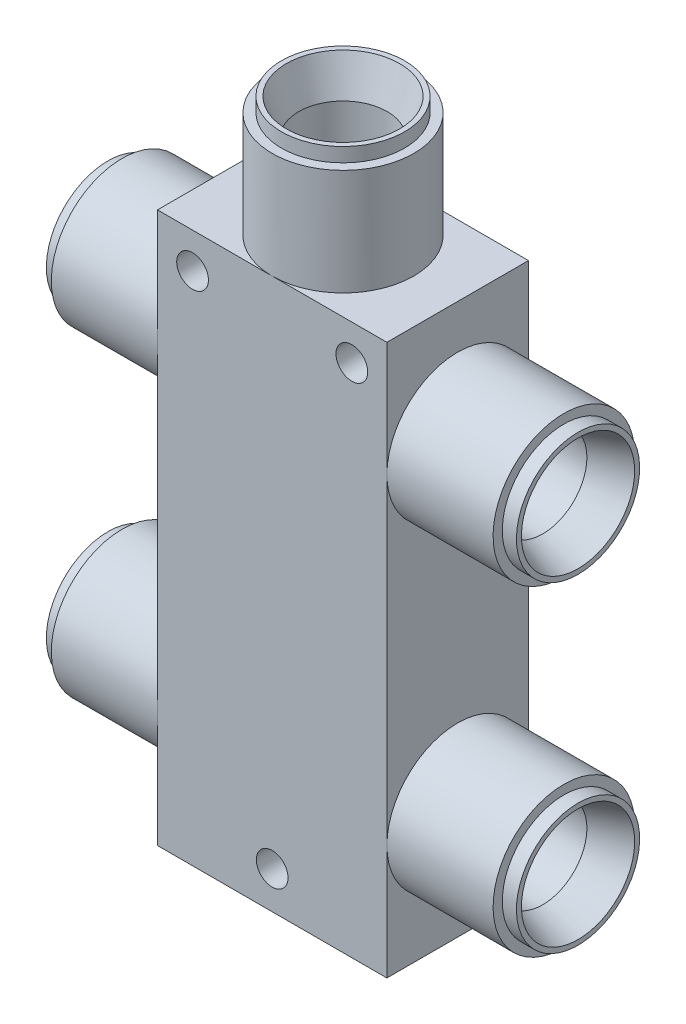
ISO-10303-21;
HEADER;
FILE_DESCRIPTION(('STEP AP214'),'2;1');
FILE_NAME('part.step','',(''),(''),'','','');
FILE_SCHEMA(('AUTOMOTIVE_DESIGN { 1 0 10303 214 1 1 1 1 }'));
ENDSEC;
DATA;
#1=APPLICATION_CONTEXT('core data for automotive mechanical design processes');
#2=APPLICATION_PROTOCOL_DEFINITION('international standard','automotive_design',2000,#1);
#3=PRODUCT_CONTEXT('',#1,'mechanical');
#4=PRODUCT('Part','Part','',(#3));
#5=PRODUCT_RELATED_PRODUCT_CATEGORY('part','',(#4));
#6=PRODUCT_DEFINITION_FORMATION('','',#4);
#7=PRODUCT_DEFINITION_CONTEXT('part definition',#1,'design');
#8=PRODUCT_DEFINITION('design','',#6,#7);
#9=PRODUCT_DEFINITION_SHAPE('','',#8);
#10=(LENGTH_UNIT() NAMED_UNIT(*) SI_UNIT(.MILLI.,.METRE.));
#11=(NAMED_UNIT(*) PLANE_ANGLE_UNIT() SI_UNIT($,.RADIAN.));
#12=(NAMED_UNIT(*) SI_UNIT($,.STERADIAN.) SOLID_ANGLE_UNIT());
#13=UNCERTAINTY_MEASURE_WITH_UNIT(LENGTH_MEASURE(1.E-05),#10,'distance_accuracy_value','');
#14=(GEOMETRIC_REPRESENTATION_CONTEXT(3) GLOBAL_UNCERTAINTY_ASSIGNED_CONTEXT((#13)) GLOBAL_UNIT_ASSIGNED_CONTEXT((#10,
#11,#12)) REPRESENTATION_CONTEXT('',''));
#15=CARTESIAN_POINT('',(0.,0.,0.));
#16=DIRECTION('',(0.,0.,1.));
#17=DIRECTION('',(1.,0.,0.));
#18=AXIS2_PLACEMENT_3D('',#15,#16,#17);
#19=CARTESIAN_POINT('',(10.287,0.,0.));
#20=DIRECTION('',(0.,-1.,0.));
#21=DIRECTION('',(0.,0.,-1.));
#22=AXIS2_PLACEMENT_3D('',#19,#20,#21);
#23=CYLINDRICAL_SURFACE('',#22,3.96875);
#24=CARTESIAN_POINT('',(10.287,56.9988667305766,0.));
#25=DIRECTION('',(0.,-1.,0.));
#26=DIRECTION('',(0.,0.,-1.));
#27=AXIS2_PLACEMENT_3D('',#24,#25,#26);
#28=CIRCLE('',#27,3.96875);
#29=CARTESIAN_POINT('',(10.287,56.9988667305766,-3.96875000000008));
#30=VERTEX_POINT('',#29);
#31=EDGE_CURVE('E190',#30,#30,#28,.T.);
#32=ORIENTED_EDGE('',*,*,#31,.F.);
#33=EDGE_LOOP('',(#32));
#34=FACE_BOUND('',#33,.T.);
#35=CARTESIAN_POINT('',(10.2870000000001,39.0918667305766,0.));
#36=DIRECTION('',(0.707106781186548,-0.707106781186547,0.));
#37=DIRECTION('',(-0.707106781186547,-0.707106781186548,0.));
#38=AXIS2_PLACEMENT_3D('',#35,#36,#37);
#39=ELLIPSE('',#38,5.61266007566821,3.96874999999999);
#40=CARTESIAN_POINT('',(10.2870000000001,39.0918667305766,3.96874999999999));
#41=VERTEX_POINT('',#40);
#42=CARTESIAN_POINT('',(10.287,39.0918667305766,-3.96875000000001));
#43=VERTEX_POINT('',#42);
#44=EDGE_CURVE('E116',#41,#43,#39,.F.);
#45=ORIENTED_EDGE('',*,*,#44,.F.);
#46=CARTESIAN_POINT('',(10.2870000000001,39.0918667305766,0.));
#47=DIRECTION('',(-0.707106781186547,-0.707106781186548,0.));
#48=DIRECTION('',(0.707106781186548,-0.707106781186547,0.));
#49=AXIS2_PLACEMENT_3D('',#46,#47,#48);
#50=ELLIPSE('',#49,5.61266007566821,3.96874999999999);
#51=EDGE_CURVE('E53',#43,#41,#50,.F.);
#52=ORIENTED_EDGE('',*,*,#51,.F.);
#53=EDGE_LOOP('',(#45,#52));
#54=FACE_BOUND('',#53,.T.);
#55=ADVANCED_FACE('F34',(#34,#54),#23,.F.);
#56=CARTESIAN_POINT('',(20.5740000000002,-19.3543781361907,-6.35));
#57=DIRECTION('',(1.,0.,0.));
#58=DIRECTION('',(0.,0.,-1.));
#59=AXIS2_PLACEMENT_3D('',#56,#57,#58);
#60=PLANE('',#59);
#61=CARTESIAN_POINT('',(20.574,10.287,0.));
#62=DIRECTION('',(1.,0.,0.));
#63=DIRECTION('',(0.,1.,0.));
#64=AXIS2_PLACEMENT_3D('',#61,#62,#63);
#65=CIRCLE('',#64,6.35);
#66=CARTESIAN_POINT('',(20.5740000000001,10.287,-6.35));
#67=VERTEX_POINT('',#66);
#68=CARTESIAN_POINT('',(20.574,10.287,6.34999999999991));
#69=VERTEX_POINT('',#68);
#70=EDGE_CURVE('E258',#67,#69,#65,.T.);
#71=ORIENTED_EDGE('',*,*,#70,.F.);
#72=DIRECTION('',(0.,1.,0.));
#73=VECTOR('',#72,1.);
#74=CARTESIAN_POINT('',(20.5740000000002,-19.3543781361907,-6.35));
#75=LINE('',#74,#73);
#76=CARTESIAN_POINT('',(20.5740000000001,39.0918667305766,-6.35000000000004));
#77=VERTEX_POINT('',#76);
#78=EDGE_CURVE('E156',#67,#77,#75,.T.);
#79=ORIENTED_EDGE('',*,*,#78,.T.);
#80=CARTESIAN_POINT('',(20.574,39.0918667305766,0.));
#81=DIRECTION('',(-1.,0.,0.));
#82=DIRECTION('',(0.,-1.,0.));
#83=AXIS2_PLACEMENT_3D('',#80,#81,#82);
#84=CIRCLE('',#83,6.34999999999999);
#85=CARTESIAN_POINT('',(20.574,39.0918667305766,6.34999999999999));
#86=VERTEX_POINT('',#85);
#87=EDGE_CURVE('E134',#77,#86,#84,.T.);
#88=ORIENTED_EDGE('',*,*,#87,.T.);
#89=DIRECTION('',(0.,1.,0.));
#90=VECTOR('',#89,1.);
#91=CARTESIAN_POINT('',(20.5740000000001,-19.3543781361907,6.34999999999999));
#92=LINE('',#91,#90);
#93=EDGE_CURVE('E173',#69,#86,#92,.T.);
#94=ORIENTED_EDGE('',*,*,#93,.F.);
#95=EDGE_LOOP('',(#71,#79,#88,#94));
#96=FACE_BOUND('',#95,.T.);
#97=ADVANCED_FACE('F326',(#96),#60,.T.);
#98=EDGE_CURVE('E255',#69,#67,#65,.T.);
#99=ORIENTED_EDGE('',*,*,#98,.F.);
#100=CARTESIAN_POINT('',(20.574,0.,6.34999999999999));
#101=VERTEX_POINT('',#100);
#102=EDGE_CURVE('E170',#101,#69,#92,.T.);
#103=ORIENTED_EDGE('',*,*,#102,.F.);
#104=DIRECTION('',(0.,0.,1.));
#105=VECTOR('',#104,1.);
#106=CARTESIAN_POINT('',(20.5740000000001,0.,-6.35));
#107=LINE('',#106,#105);
#108=CARTESIAN_POINT('',(20.5740000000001,0.,-6.35));
#109=VERTEX_POINT('',#108);
#110=EDGE_CURVE('E135',#109,#101,#107,.T.);
#111=ORIENTED_EDGE('',*,*,#110,.F.);
#112=EDGE_CURVE('E154',#109,#67,#75,.T.);
#113=ORIENTED_EDGE('',*,*,#112,.T.);
#114=EDGE_LOOP('',(#99,#103,#111,#113));
#115=FACE_BOUND('',#114,.T.);
#116=ADVANCED_FACE('F319',(#115),#60,.T.);
#117=CARTESIAN_POINT('',(1.94289029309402E-13,-19.3543781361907,-6.3500000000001));
#118=DIRECTION('',(1.,0.,0.));
#119=DIRECTION('',(0.,0.,-1.));
#120=AXIS2_PLACEMENT_3D('',#117,#118,#119);
#121=PLANE('',#120);
#122=CARTESIAN_POINT('',(0.,10.287,0.));
#123=DIRECTION('',(1.,0.,0.));
#124=DIRECTION('',(0.,1.,0.));
#125=AXIS2_PLACEMENT_3D('',#122,#123,#124);
#126=CIRCLE('',#125,6.35000000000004);
#127=CARTESIAN_POINT('',(0.,10.287,6.34999999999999));
#128=VERTEX_POINT('',#127);
#129=CARTESIAN_POINT('',(0.,10.287,-6.35000000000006));
#130=VERTEX_POINT('',#129);
#131=EDGE_CURVE('E233',#128,#130,#126,.T.);
#132=ORIENTED_EDGE('',*,*,#131,.T.);
#133=DIRECTION('',(0.,1.,0.));
#134=VECTOR('',#133,1.);
#135=CARTESIAN_POINT('',(1.94289029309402E-13,-19.3543781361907,-6.3500000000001));
#136=LINE('',#135,#134);
#137=CARTESIAN_POINT('',(0.,0.,-6.35000000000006));
#138=VERTEX_POINT('',#137);
#139=EDGE_CURVE('E138',#138,#130,#136,.T.);
#140=ORIENTED_EDGE('',*,*,#139,.F.);
#141=DIRECTION('',(0.,0.,1.));
#142=VECTOR('',#141,1.);
#143=CARTESIAN_POINT('',(0.,0.,-6.35000000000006));
#144=LINE('',#143,#142);
#145=CARTESIAN_POINT('',(0.,0.,6.34999999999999));
#146=VERTEX_POINT('',#145);
#147=EDGE_CURVE('E144',#138,#146,#144,.T.);
#148=ORIENTED_EDGE('',*,*,#147,.T.);
#149=DIRECTION('',(0.,1.,0.));
#150=VECTOR('',#149,1.);
#151=CARTESIAN_POINT('',(1.04083408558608E-13,-19.3543781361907,6.34999999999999));
#152=LINE('',#151,#150);
#153=EDGE_CURVE('E161',#146,#128,#152,.T.);
#154=ORIENTED_EDGE('',*,*,#153,.T.);
#155=EDGE_LOOP('',(#132,#140,#148,#154));
#156=FACE_BOUND('',#155,.T.);
#157=ADVANCED_FACE('F362',(#156),#121,.F.);
#158=EDGE_CURVE('E236',#130,#128,#126,.T.);
#159=ORIENTED_EDGE('',*,*,#158,.T.);
#160=CARTESIAN_POINT('',(0.,39.0918667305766,6.34999999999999));
#161=VERTEX_POINT('',#160);
#162=EDGE_CURVE('E164',#128,#161,#152,.T.);
#163=ORIENTED_EDGE('',*,*,#162,.T.);
#164=CARTESIAN_POINT('',(0.,39.0918667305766,0.));
#165=DIRECTION('',(-1.,0.,0.));
#166=DIRECTION('',(0.,-1.,0.));
#167=AXIS2_PLACEMENT_3D('',#164,#165,#166);
#168=CIRCLE('',#167,6.34999999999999);
#169=CARTESIAN_POINT('',(1.11022302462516E-13,39.0918667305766,-6.35000000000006));
#170=VERTEX_POINT('',#169);
#171=EDGE_CURVE('E203',#170,#161,#168,.T.);
#172=ORIENTED_EDGE('',*,*,#171,.F.);
#173=EDGE_CURVE('E148',#130,#170,#136,.T.);
#174=ORIENTED_EDGE('',*,*,#173,.F.);
#175=EDGE_LOOP('',(#159,#163,#172,#174));
#176=FACE_BOUND('',#175,.T.);
#177=ADVANCED_FACE('F357',(#176),#121,.F.);
#178=CARTESIAN_POINT('',(20.574,49.3788667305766,6.35000000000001));
#179=VERTEX_POINT('',#178);
#180=EDGE_CURVE('E174',#86,#179,#92,.T.);
#181=ORIENTED_EDGE('',*,*,#180,.F.);
#182=EDGE_CURVE('E215',#86,#77,#84,.T.);
#183=ORIENTED_EDGE('',*,*,#182,.T.);
#184=CARTESIAN_POINT('',(20.5740000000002,49.3788667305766,-6.35));
#185=VERTEX_POINT('',#184);
#186=EDGE_CURVE('E157',#77,#185,#75,.T.);
#187=ORIENTED_EDGE('',*,*,#186,.T.);
#188=DIRECTION('',(0.,0.,1.));
#189=VECTOR('',#188,1.);
#190=CARTESIAN_POINT('',(20.5740000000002,49.3788667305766,-6.35));
#191=LINE('',#190,#189);
#192=EDGE_CURVE('E137',#185,#179,#191,.T.);
#193=ORIENTED_EDGE('',*,*,#192,.T.);
#194=EDGE_LOOP('',(#181,#183,#187,#193));
#195=FACE_BOUND('',#194,.T.);
#196=ADVANCED_FACE('F338',(#195),#60,.T.);
#197=EDGE_CURVE('E199',#161,#170,#168,.T.);
#198=ORIENTED_EDGE('',*,*,#197,.F.);
#199=CARTESIAN_POINT('',(0.,49.3788667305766,6.34999999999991));
#200=VERTEX_POINT('',#199);
#201=EDGE_CURVE('E165',#161,#200,#152,.T.);
#202=ORIENTED_EDGE('',*,*,#201,.T.);
#203=DIRECTION('',(0.,0.,1.));
#204=VECTOR('',#203,1.);
#205=CARTESIAN_POINT('',(1.73472347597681E-13,49.3788667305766,-6.35000000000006));
#206=LINE('',#205,#204);
#207=CARTESIAN_POINT('',(1.73472347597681E-13,49.3788667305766,-6.35000000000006));
#208=VERTEX_POINT('',#207);
#209=EDGE_CURVE('E141',#208,#200,#206,.T.);
#210=ORIENTED_EDGE('',*,*,#209,.F.);
#211=EDGE_CURVE('E149',#170,#208,#136,.T.);
#212=ORIENTED_EDGE('',*,*,#211,.F.);
#213=EDGE_LOOP('',(#198,#202,#210,#212));
#214=FACE_BOUND('',#213,.T.);
#215=ADVANCED_FACE('F360',(#214),#121,.F.);
#216=CARTESIAN_POINT('',(10.1334992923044,49.3788667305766,-6.35));
#217=DIRECTION('',(0.,-1.,0.));
#218=DIRECTION('',(0.,0.,-1.));
#219=AXIS2_PLACEMENT_3D('',#216,#217,#218);
#220=PLANE('',#219);
#221=DIRECTION('',(1.,0.,0.));
#222=VECTOR('',#221,1.);
#223=CARTESIAN_POINT('',(10.1334992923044,49.3788667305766,-6.35));
#224=LINE('',#223,#222);
#225=CARTESIAN_POINT('',(10.2870000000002,49.3788667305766,-6.35));
#226=VERTEX_POINT('',#225);
#227=EDGE_CURVE('E153',#226,#185,#224,.T.);
#228=ORIENTED_EDGE('',*,*,#227,.F.);
#229=CARTESIAN_POINT('',(10.2870000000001,49.3788667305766,0.));
#230=DIRECTION('',(0.,-1.,0.));
#231=DIRECTION('',(0.,0.,-1.));
#232=AXIS2_PLACEMENT_3D('',#229,#230,#231);
#233=CIRCLE('',#232,6.35);
#234=CARTESIAN_POINT('',(10.2870000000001,49.3788667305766,6.35000000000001));
#235=VERTEX_POINT('',#234);
#236=EDGE_CURVE('E187',#226,#235,#233,.T.);
#237=ORIENTED_EDGE('',*,*,#236,.T.);
#238=DIRECTION('',(1.,0.,0.));
#239=VECTOR('',#238,1.);
#240=CARTESIAN_POINT('',(10.1334992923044,49.3788667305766,6.35000000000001));
#241=LINE('',#240,#239);
#242=EDGE_CURVE('E169',#235,#179,#241,.T.);
#243=ORIENTED_EDGE('',*,*,#242,.T.);
#244=ORIENTED_EDGE('',*,*,#192,.F.);
#245=EDGE_LOOP('',(#228,#237,#243,#244));
#246=FACE_BOUND('',#245,.T.);
#247=ADVANCED_FACE('F337',(#246),#220,.F.);
#248=CARTESIAN_POINT('',(10.1334992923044,0.,-6.35));
#249=DIRECTION('',(0.,-1.,0.));
#250=DIRECTION('',(0.,0.,-1.));
#251=AXIS2_PLACEMENT_3D('',#248,#249,#250);
#252=PLANE('',#251);
#253=ORIENTED_EDGE('',*,*,#110,.T.);
#254=DIRECTION('',(1.,0.,0.));
#255=VECTOR('',#254,1.);
#256=CARTESIAN_POINT('',(10.1334992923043,0.,6.34999999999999));
#257=LINE('',#256,#255);
#258=EDGE_CURVE('E175',#146,#101,#257,.T.);
#259=ORIENTED_EDGE('',*,*,#258,.F.);
#260=ORIENTED_EDGE('',*,*,#147,.F.);
#261=DIRECTION('',(1.,0.,0.));
#262=VECTOR('',#261,1.);
#263=CARTESIAN_POINT('',(10.1334992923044,0.,-6.35));
#264=LINE('',#263,#262);
#265=EDGE_CURVE('E158',#138,#109,#264,.T.);
#266=ORIENTED_EDGE('',*,*,#265,.T.);
#267=EDGE_LOOP('',(#253,#259,#260,#266));
#268=FACE_BOUND('',#267,.T.);
#269=ADVANCED_FACE('F36',(#268),#252,.T.);
#270=EDGE_CURVE('E166',#200,#235,#241,.T.);
#271=ORIENTED_EDGE('',*,*,#270,.T.);
#272=EDGE_CURVE('E146',#235,#226,#233,.T.);
#273=ORIENTED_EDGE('',*,*,#272,.T.);
#274=EDGE_CURVE('E150',#208,#226,#224,.T.);
#275=ORIENTED_EDGE('',*,*,#274,.F.);
#276=ORIENTED_EDGE('',*,*,#209,.T.);
#277=EDGE_LOOP('',(#271,#273,#275,#276));
#278=FACE_BOUND('',#277,.T.);
#279=ADVANCED_FACE('F347',(#278),#220,.F.);
#280=CARTESIAN_POINT('',(10.1334992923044,-19.3543781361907,-6.35));
#281=DIRECTION('',(0.,0.,1.));
#282=DIRECTION('',(1.,0.,0.));
#283=AXIS2_PLACEMENT_3D('',#280,#281,#282);
#284=PLANE('',#283);
#285=CARTESIAN_POINT('',(17.4307500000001,46.2038667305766,-6.35000000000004));
#286=DIRECTION('',(0.,0.,1.));
#287=DIRECTION('',(1.,0.,0.));
#288=AXIS2_PLACEMENT_3D('',#285,#286,#287);
#289=CIRCLE('',#288,1.4224);
#290=CARTESIAN_POINT('',(18.8531500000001,46.2038667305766,-6.35000000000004));
#291=VERTEX_POINT('',#290);
#292=EDGE_CURVE('E286',#291,#291,#289,.T.);
#293=ORIENTED_EDGE('',*,*,#292,.T.);
#294=EDGE_LOOP('',(#293));
#295=FACE_BOUND('',#294,.T.);
#296=CARTESIAN_POINT('',(10.2870000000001,3.34136673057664,-6.35000000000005));
#297=DIRECTION('',(0.,0.,1.));
#298=DIRECTION('',(1.,0.,0.));
#299=AXIS2_PLACEMENT_3D('',#296,#297,#298);
#300=CIRCLE('',#299,1.4224);
#301=CARTESIAN_POINT('',(11.7094000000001,3.34136673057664,-6.35000000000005));
#302=VERTEX_POINT('',#301);
#303=EDGE_CURVE('E280',#302,#302,#300,.T.);
#304=ORIENTED_EDGE('',*,*,#303,.T.);
#305=EDGE_LOOP('',(#304));
#306=FACE_BOUND('',#305,.T.);
#307=CARTESIAN_POINT('',(3.1432500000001,46.2038667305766,-6.35000000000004));
#308=DIRECTION('',(0.,0.,1.));
#309=DIRECTION('',(1.,0.,0.));
#310=AXIS2_PLACEMENT_3D('',#307,#308,#309);
#311=CIRCLE('',#310,1.4224);
#312=CARTESIAN_POINT('',(4.56565000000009,46.2038667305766,-6.35000000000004));
#313=VERTEX_POINT('',#312);
#314=EDGE_CURVE('E274',#313,#313,#311,.T.);
#315=ORIENTED_EDGE('',*,*,#314,.T.);
#316=EDGE_LOOP('',(#315));
#317=FACE_BOUND('',#316,.T.);
#318=ORIENTED_EDGE('',*,*,#265,.F.);
#319=ORIENTED_EDGE('',*,*,#139,.T.);
#320=ORIENTED_EDGE('',*,*,#173,.T.);
#321=ORIENTED_EDGE('',*,*,#211,.T.);
#322=ORIENTED_EDGE('',*,*,#274,.T.);
#323=ORIENTED_EDGE('',*,*,#227,.T.);
#324=ORIENTED_EDGE('',*,*,#186,.F.);
#325=ORIENTED_EDGE('',*,*,#78,.F.);
#326=ORIENTED_EDGE('',*,*,#112,.F.);
#327=EDGE_LOOP('',(#318,#319,#320,#321,#322,#323,#324,#325,#326));
#328=FACE_BOUND('',#327,.T.);
#329=ADVANCED_FACE('F290',(#295,#306,#317,#328),#284,.F.);
#330=CARTESIAN_POINT('',(10.1334992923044,-19.3543781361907,6.34999999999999));
#331=DIRECTION('',(0.,0.,1.));
#332=DIRECTION('',(1.,0.,0.));
#333=AXIS2_PLACEMENT_3D('',#330,#331,#332);
#334=PLANE('',#333);
#335=CARTESIAN_POINT('',(17.43075,46.2038667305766,6.34999999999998));
#336=DIRECTION('',(0.,0.,1.));
#337=DIRECTION('',(1.,0.,0.));
#338=AXIS2_PLACEMENT_3D('',#335,#336,#337);
#339=CIRCLE('',#338,1.42239999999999);
#340=CARTESIAN_POINT('',(18.85315,46.2038667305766,6.34999999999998));
#341=VERTEX_POINT('',#340);
#342=EDGE_CURVE('E283',#341,#341,#339,.T.);
#343=ORIENTED_EDGE('',*,*,#342,.F.);
#344=EDGE_LOOP('',(#343));
#345=FACE_BOUND('',#344,.T.);
#346=CARTESIAN_POINT('',(10.287,3.34136673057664,6.34999999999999));
#347=DIRECTION('',(0.,0.,1.));
#348=DIRECTION('',(1.,0.,0.));
#349=AXIS2_PLACEMENT_3D('',#346,#347,#348);
#350=CIRCLE('',#349,1.42239999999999);
#351=CARTESIAN_POINT('',(11.7094,3.34136673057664,6.34999999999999));
#352=VERTEX_POINT('',#351);
#353=EDGE_CURVE('E277',#352,#352,#350,.T.);
#354=ORIENTED_EDGE('',*,*,#353,.F.);
#355=EDGE_LOOP('',(#354));
#356=FACE_BOUND('',#355,.T.);
#357=CARTESIAN_POINT('',(3.14325000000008,46.2038667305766,6.34999999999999));
#358=DIRECTION('',(0.,0.,1.));
#359=DIRECTION('',(1.,0.,0.));
#360=AXIS2_PLACEMENT_3D('',#357,#358,#359);
#361=CIRCLE('',#360,1.42239999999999);
#362=CARTESIAN_POINT('',(4.56565000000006,46.2038667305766,6.34999999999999));
#363=VERTEX_POINT('',#362);
#364=EDGE_CURVE('E271',#363,#363,#361,.T.);
#365=ORIENTED_EDGE('',*,*,#364,.F.);
#366=EDGE_LOOP('',(#365));
#367=FACE_BOUND('',#366,.T.);
#368=ORIENTED_EDGE('',*,*,#258,.T.);
#369=ORIENTED_EDGE('',*,*,#102,.T.);
#370=ORIENTED_EDGE('',*,*,#93,.T.);
#371=ORIENTED_EDGE('',*,*,#180,.T.);
#372=ORIENTED_EDGE('',*,*,#242,.F.);
#373=ORIENTED_EDGE('',*,*,#270,.F.);
#374=ORIENTED_EDGE('',*,*,#201,.F.);
#375=ORIENTED_EDGE('',*,*,#162,.F.);
#376=ORIENTED_EDGE('',*,*,#153,.F.);
#377=EDGE_LOOP('',(#368,#369,#370,#371,#372,#373,#374,#375,#376));
#378=FACE_BOUND('',#377,.T.);
#379=ADVANCED_FACE('F300',(#345,#356,#367,#378),#334,.T.);
#380=CARTESIAN_POINT('',(10.1334992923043,60.1738667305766,0.));
#381=DIRECTION('',(0.,-1.,0.));
#382=DIRECTION('',(0.,0.,-1.));
#383=AXIS2_PLACEMENT_3D('',#380,#381,#382);
#384=PLANE('',#383);
#385=CARTESIAN_POINT('',(10.287,60.1738667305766,0.));
#386=DIRECTION('',(0.,-1.,0.));
#387=DIRECTION('',(0.,0.,-1.));
#388=AXIS2_PLACEMENT_3D('',#385,#386,#387);
#389=CIRCLE('',#388,5.5245);
#390=CARTESIAN_POINT('',(10.287,60.1738667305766,-5.5245));
#391=VERTEX_POINT('',#390);
#392=EDGE_CURVE('E178',#391,#391,#389,.T.);
#393=ORIENTED_EDGE('',*,*,#392,.F.);
#394=EDGE_LOOP('',(#393));
#395=FACE_BOUND('',#394,.T.);
#396=CARTESIAN_POINT('',(10.287,60.1738667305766,0.));
#397=DIRECTION('',(0.,-1.,0.));
#398=DIRECTION('',(0.,0.,-1.));
#399=AXIS2_PLACEMENT_3D('',#396,#397,#398);
#400=CIRCLE('',#399,5.07999999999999);
#401=CARTESIAN_POINT('',(10.287,60.1738667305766,-5.07999999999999));
#402=VERTEX_POINT('',#401);
#403=EDGE_CURVE('E193',#402,#402,#400,.T.);
#404=ORIENTED_EDGE('',*,*,#403,.T.);
#405=EDGE_LOOP('',(#404));
#406=FACE_BOUND('',#405,.T.);
#407=ADVANCED_FACE('F303',(#395,#406),#384,.F.);
#408=CARTESIAN_POINT('',(10.287,0.,0.));
#409=DIRECTION('',(0.,-1.,0.));
#410=DIRECTION('',(0.,0.,-1.));
#411=AXIS2_PLACEMENT_3D('',#408,#409,#410);
#412=CYLINDRICAL_SURFACE('',#411,5.5245);
#413=CARTESIAN_POINT('',(10.287,58.9038667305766,0.));
#414=DIRECTION('',(0.,-1.,0.));
#415=DIRECTION('',(0.,0.,-1.));
#416=AXIS2_PLACEMENT_3D('',#413,#414,#415);
#417=CIRCLE('',#416,5.5245);
#418=CARTESIAN_POINT('',(10.287,58.9038667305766,-5.52450000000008));
#419=VERTEX_POINT('',#418);
#420=EDGE_CURVE('E181',#419,#419,#417,.T.);
#421=ORIENTED_EDGE('',*,*,#420,.F.);
#422=EDGE_LOOP('',(#421));
#423=FACE_BOUND('',#422,.T.);
#424=ORIENTED_EDGE('',*,*,#392,.T.);
#425=EDGE_LOOP('',(#424));
#426=FACE_BOUND('',#425,.T.);
#427=ADVANCED_FACE('F422',(#423,#426),#412,.T.);
#428=CARTESIAN_POINT('',(10.1334992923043,58.9038667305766,0.));
#429=DIRECTION('',(0.,-1.,0.));
#430=DIRECTION('',(0.,0.,-1.));
#431=AXIS2_PLACEMENT_3D('',#428,#429,#430);
#432=PLANE('',#431);
#433=CARTESIAN_POINT('',(10.287,58.9038667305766,0.));
#434=DIRECTION('',(0.,-1.,0.));
#435=DIRECTION('',(0.,0.,-1.));
#436=AXIS2_PLACEMENT_3D('',#433,#434,#435);
#437=CIRCLE('',#436,6.35);
#438=CARTESIAN_POINT('',(10.287,58.9038667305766,-6.35000000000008));
#439=VERTEX_POINT('',#438);
#440=EDGE_CURVE('E184',#439,#439,#437,.T.);
#441=ORIENTED_EDGE('',*,*,#440,.F.);
#442=EDGE_LOOP('',(#441));
#443=FACE_BOUND('',#442,.T.);
#444=ORIENTED_EDGE('',*,*,#420,.T.);
#445=EDGE_LOOP('',(#444));
#446=FACE_BOUND('',#445,.T.);
#447=ADVANCED_FACE('F419',(#443,#446),#432,.F.);
#448=CARTESIAN_POINT('',(10.287,0.,0.));
#449=DIRECTION('',(0.,-1.,0.));
#450=DIRECTION('',(0.,0.,-1.));
#451=AXIS2_PLACEMENT_3D('',#448,#449,#450);
#452=CYLINDRICAL_SURFACE('',#451,6.35);
#453=ORIENTED_EDGE('',*,*,#236,.F.);
#454=ORIENTED_EDGE('',*,*,#272,.F.);
#455=EDGE_LOOP('',(#453,#454));
#456=FACE_BOUND('',#455,.T.);
#457=ORIENTED_EDGE('',*,*,#440,.T.);
#458=EDGE_LOOP('',(#457));
#459=FACE_BOUND('',#458,.T.);
#460=ADVANCED_FACE('F416',(#456,#459),#452,.T.);
#461=CARTESIAN_POINT('',(10.287,56.9988667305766,0.));
#462=DIRECTION('',(0.,1.,0.));
#463=DIRECTION('',(0.,0.,1.));
#464=AXIS2_PLACEMENT_3D('',#461,#462,#463);
#465=CONICAL_SURFACE('',#464,3.96875,0.336674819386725);
#466=ORIENTED_EDGE('',*,*,#403,.F.);
#467=EDGE_LOOP('',(#466));
#468=FACE_BOUND('',#467,.T.);
#469=ORIENTED_EDGE('',*,*,#31,.T.);
#470=EDGE_LOOP('',(#469));
#471=FACE_BOUND('',#470,.T.);
#472=ADVANCED_FACE('F414',(#468,#471),#465,.F.);
#473=CARTESIAN_POINT('',(-9.52499999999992,-19.3543781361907,0.));
#474=DIRECTION('',(-1.,0.,0.));
#475=DIRECTION('',(0.,-1.,0.));
#476=AXIS2_PLACEMENT_3D('',#473,#474,#475);
#477=PLANE('',#476);
#478=CARTESIAN_POINT('',(-9.52499999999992,39.0918667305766,0.));
#479=DIRECTION('',(-1.,0.,0.));
#480=DIRECTION('',(0.,-1.,0.));
#481=AXIS2_PLACEMENT_3D('',#478,#479,#480);
#482=CIRCLE('',#481,6.35);
#483=CARTESIAN_POINT('',(-9.52499999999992,32.7418667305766,0.));
#484=VERTEX_POINT('',#483);
#485=EDGE_CURVE('E196',#484,#484,#482,.T.);
#486=ORIENTED_EDGE('',*,*,#485,.T.);
#487=EDGE_LOOP('',(#486));
#488=FACE_BOUND('',#487,.T.);
#489=CARTESIAN_POINT('',(-9.52499999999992,39.0918667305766,0.));
#490=DIRECTION('',(-1.,0.,0.));
#491=DIRECTION('',(0.,-1.,0.));
#492=AXIS2_PLACEMENT_3D('',#489,#490,#491);
#493=CIRCLE('',#492,5.52450000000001);
#494=CARTESIAN_POINT('',(-9.52499999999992,33.5673667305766,0.));
#495=VERTEX_POINT('',#494);
#496=EDGE_CURVE('E212',#495,#495,#493,.T.);
#497=ORIENTED_EDGE('',*,*,#496,.F.);
#498=EDGE_LOOP('',(#497));
#499=FACE_BOUND('',#498,.T.);
#500=ADVANCED_FACE('F464',(#488,#499),#477,.T.);
#501=CARTESIAN_POINT('',(-17.78,39.0918667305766,0.));
#502=DIRECTION('',(-1.,0.,0.));
#503=DIRECTION('',(0.,-1.,0.));
#504=AXIS2_PLACEMENT_3D('',#501,#502,#503);
#505=CYLINDRICAL_SURFACE('',#504,6.35);
#506=ORIENTED_EDGE('',*,*,#197,.T.);
#507=ORIENTED_EDGE('',*,*,#171,.T.);
#508=EDGE_LOOP('',(#506,#507));
#509=FACE_BOUND('',#508,.T.);
#510=ORIENTED_EDGE('',*,*,#485,.F.);
#511=EDGE_LOOP('',(#510));
#512=FACE_BOUND('',#511,.T.);
#513=ADVANCED_FACE('F352',(#509,#512),#505,.T.);
#514=CARTESIAN_POINT('',(-17.78,39.0918667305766,0.));
#515=DIRECTION('',(-1.,0.,0.));
#516=DIRECTION('',(0.,-1.,0.));
#517=AXIS2_PLACEMENT_3D('',#514,#515,#516);
#518=CYLINDRICAL_SURFACE('',#517,3.96874999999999);
#519=CARTESIAN_POINT('',(-7.61999999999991,39.0918667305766,0.));
#520=DIRECTION('',(-1.,0.,0.));
#521=DIRECTION('',(0.,-1.,0.));
#522=AXIS2_PLACEMENT_3D('',#519,#520,#521);
#523=CIRCLE('',#522,3.96875);
#524=CARTESIAN_POINT('',(-7.61999999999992,35.1231167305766,0.));
#525=VERTEX_POINT('',#524);
#526=EDGE_CURVE('E202',#525,#525,#523,.T.);
#527=ORIENTED_EDGE('',*,*,#526,.T.);
#528=EDGE_LOOP('',(#527));
#529=FACE_BOUND('',#528,.T.);
#530=CARTESIAN_POINT('',(10.2870000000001,39.0918667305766,0.));
#531=DIRECTION('',(0.707106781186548,-0.707106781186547,0.));
#532=DIRECTION('',(-0.707106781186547,-0.707106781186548,0.));
#533=AXIS2_PLACEMENT_3D('',#530,#531,#532);
#534=ELLIPSE('',#533,5.61266007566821,3.96874999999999);
#535=EDGE_CURVE('E125',#41,#43,#534,.T.);
#536=ORIENTED_EDGE('',*,*,#535,.T.);
#537=ORIENTED_EDGE('',*,*,#51,.T.);
#538=EDGE_LOOP('',(#536,#537));
#539=FACE_BOUND('',#538,.T.);
#540=ADVANCED_FACE('F476',(#529,#539),#518,.F.);
#541=CARTESIAN_POINT('',(-7.61999999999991,39.0918667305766,0.));
#542=DIRECTION('',(-1.,0.,0.));
#543=DIRECTION('',(0.,-1.,0.));
#544=AXIS2_PLACEMENT_3D('',#541,#542,#543);
#545=CONICAL_SURFACE('',#544,3.96874999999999,0.336674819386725);
#546=CARTESIAN_POINT('',(-10.7949999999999,39.0918667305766,0.));
#547=DIRECTION('',(-1.,0.,0.));
#548=DIRECTION('',(0.,-1.,0.));
#549=AXIS2_PLACEMENT_3D('',#546,#547,#548);
#550=CIRCLE('',#549,5.07999999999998);
#551=CARTESIAN_POINT('',(-10.7949999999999,34.0118667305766,0.));
#552=VERTEX_POINT('',#551);
#553=EDGE_CURVE('E206',#552,#552,#550,.T.);
#554=ORIENTED_EDGE('',*,*,#553,.T.);
#555=EDGE_LOOP('',(#554));
#556=FACE_BOUND('',#555,.T.);
#557=ORIENTED_EDGE('',*,*,#526,.F.);
#558=EDGE_LOOP('',(#557));
#559=FACE_BOUND('',#558,.T.);
#560=ADVANCED_FACE('F484',(#556,#559),#545,.F.);
#561=CARTESIAN_POINT('',(-10.7949999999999,-19.3543781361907,0.));
#562=DIRECTION('',(-1.,0.,0.));
#563=DIRECTION('',(0.,-1.,0.));
#564=AXIS2_PLACEMENT_3D('',#561,#562,#563);
#565=PLANE('',#564);
#566=CARTESIAN_POINT('',(-10.7949999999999,39.0918667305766,0.));
#567=DIRECTION('',(-1.,0.,0.));
#568=DIRECTION('',(0.,-1.,0.));
#569=AXIS2_PLACEMENT_3D('',#566,#567,#568);
#570=CIRCLE('',#569,5.52450000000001);
#571=CARTESIAN_POINT('',(-10.7949999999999,33.5673667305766,0.));
#572=VERTEX_POINT('',#571);
#573=EDGE_CURVE('E209',#572,#572,#570,.T.);
#574=ORIENTED_EDGE('',*,*,#573,.T.);
#575=EDGE_LOOP('',(#574));
#576=FACE_BOUND('',#575,.T.);
#577=ORIENTED_EDGE('',*,*,#553,.F.);
#578=EDGE_LOOP('',(#577));
#579=FACE_BOUND('',#578,.T.);
#580=ADVANCED_FACE('F494',(#576,#579),#565,.T.);
#581=CARTESIAN_POINT('',(-17.78,39.0918667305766,0.));
#582=DIRECTION('',(-1.,0.,0.));
#583=DIRECTION('',(0.,-1.,0.));
#584=AXIS2_PLACEMENT_3D('',#581,#582,#583);
#585=CYLINDRICAL_SURFACE('',#584,5.52450000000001);
#586=ORIENTED_EDGE('',*,*,#496,.T.);
#587=EDGE_LOOP('',(#586));
#588=FACE_BOUND('',#587,.T.);
#589=ORIENTED_EDGE('',*,*,#573,.F.);
#590=EDGE_LOOP('',(#589));
#591=FACE_BOUND('',#590,.T.);
#592=ADVANCED_FACE('F502',(#588,#591),#585,.T.);
#593=CARTESIAN_POINT('',(-17.78,39.0918667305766,0.));
#594=DIRECTION('',(-1.,0.,0.));
#595=DIRECTION('',(0.,-1.,0.));
#596=AXIS2_PLACEMENT_3D('',#593,#594,#595);
#597=CYLINDRICAL_SURFACE('',#596,3.96874999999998);
#598=CARTESIAN_POINT('',(28.194,39.0918667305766,0.));
#599=DIRECTION('',(-1.,0.,0.));
#600=DIRECTION('',(0.,-1.,0.));
#601=AXIS2_PLACEMENT_3D('',#598,#599,#600);
#602=CIRCLE('',#601,3.96874999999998);
#603=CARTESIAN_POINT('',(28.194,35.1231167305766,0.));
#604=VERTEX_POINT('',#603);
#605=EDGE_CURVE('E230',#604,#604,#602,.T.);
#606=ORIENTED_EDGE('',*,*,#605,.F.);
#607=EDGE_LOOP('',(#606));
#608=FACE_BOUND('',#607,.T.);
#609=ORIENTED_EDGE('',*,*,#44,.T.);
#610=CARTESIAN_POINT('',(10.2870000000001,39.0918667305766,0.));
#611=DIRECTION('',(-0.707106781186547,-0.707106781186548,0.));
#612=DIRECTION('',(0.707106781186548,-0.707106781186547,0.));
#613=AXIS2_PLACEMENT_3D('',#610,#611,#612);
#614=ELLIPSE('',#613,5.61266007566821,3.96874999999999);
#615=EDGE_CURVE('E126',#43,#41,#614,.T.);
#616=ORIENTED_EDGE('',*,*,#615,.T.);
#617=EDGE_LOOP('',(#609,#616));
#618=FACE_BOUND('',#617,.T.);
#619=ADVANCED_FACE('F510',(#608,#618),#597,.F.);
#620=CARTESIAN_POINT('',(-17.78,39.0918667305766,0.));
#621=DIRECTION('',(-1.,0.,0.));
#622=DIRECTION('',(0.,-1.,0.));
#623=AXIS2_PLACEMENT_3D('',#620,#621,#622);
#624=CYLINDRICAL_SURFACE('',#623,6.34999999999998);
#625=ORIENTED_EDGE('',*,*,#182,.F.);
#626=ORIENTED_EDGE('',*,*,#87,.F.);
#627=EDGE_LOOP('',(#625,#626));
#628=FACE_BOUND('',#627,.T.);
#629=CARTESIAN_POINT('',(30.099,39.0918667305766,0.));
#630=DIRECTION('',(-1.,0.,0.));
#631=DIRECTION('',(0.,-1.,0.));
#632=AXIS2_PLACEMENT_3D('',#629,#630,#631);
#633=CIRCLE('',#632,6.34999999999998);
#634=CARTESIAN_POINT('',(30.099,32.7418667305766,0.));
#635=VERTEX_POINT('',#634);
#636=EDGE_CURVE('E218',#635,#635,#633,.T.);
#637=ORIENTED_EDGE('',*,*,#636,.T.);
#638=EDGE_LOOP('',(#637));
#639=FACE_BOUND('',#638,.T.);
#640=ADVANCED_FACE('F518',(#628,#639),#624,.T.);
#641=CARTESIAN_POINT('',(30.0990000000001,-19.3543781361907,0.));
#642=DIRECTION('',(-1.,0.,0.));
#643=DIRECTION('',(0.,-1.,0.));
#644=AXIS2_PLACEMENT_3D('',#641,#642,#643);
#645=PLANE('',#644);
#646=ORIENTED_EDGE('',*,*,#636,.F.);
#647=EDGE_LOOP('',(#646));
#648=FACE_BOUND('',#647,.T.);
#649=CARTESIAN_POINT('',(30.099,39.0918667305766,0.));
#650=DIRECTION('',(-1.,0.,0.));
#651=DIRECTION('',(0.,-1.,0.));
#652=AXIS2_PLACEMENT_3D('',#649,#650,#651);
#653=CIRCLE('',#652,5.52449999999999);
#654=CARTESIAN_POINT('',(30.099,33.5673667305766,0.));
#655=VERTEX_POINT('',#654);
#656=EDGE_CURVE('E221',#655,#655,#653,.T.);
#657=ORIENTED_EDGE('',*,*,#656,.T.);
#658=EDGE_LOOP('',(#657));
#659=FACE_BOUND('',#658,.T.);
#660=ADVANCED_FACE('F528',(#648,#659),#645,.F.);
#661=CARTESIAN_POINT('',(-17.78,39.0918667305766,0.));
#662=DIRECTION('',(-1.,0.,0.));
#663=DIRECTION('',(0.,-1.,0.));
#664=AXIS2_PLACEMENT_3D('',#661,#662,#663);
#665=CYLINDRICAL_SURFACE('',#664,5.52449999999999);
#666=ORIENTED_EDGE('',*,*,#656,.F.);
#667=EDGE_LOOP('',(#666));
#668=FACE_BOUND('',#667,.T.);
#669=CARTESIAN_POINT('',(31.369,39.0918667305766,0.));
#670=DIRECTION('',(-1.,0.,0.));
#671=DIRECTION('',(0.,-1.,0.));
#672=AXIS2_PLACEMENT_3D('',#669,#670,#671);
#673=CIRCLE('',#672,5.52449999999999);
#674=CARTESIAN_POINT('',(31.369,33.5673667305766,0.));
#675=VERTEX_POINT('',#674);
#676=EDGE_CURVE('E224',#675,#675,#673,.T.);
#677=ORIENTED_EDGE('',*,*,#676,.T.);
#678=EDGE_LOOP('',(#677));
#679=FACE_BOUND('',#678,.T.);
#680=ADVANCED_FACE('F536',(#668,#679),#665,.T.);
#681=CARTESIAN_POINT('',(31.3690000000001,-19.3543781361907,0.));
#682=DIRECTION('',(-1.,0.,0.));
#683=DIRECTION('',(0.,-1.,0.));
#684=AXIS2_PLACEMENT_3D('',#681,#682,#683);
#685=PLANE('',#684);
#686=ORIENTED_EDGE('',*,*,#676,.F.);
#687=EDGE_LOOP('',(#686));
#688=FACE_BOUND('',#687,.T.);
#689=CARTESIAN_POINT('',(31.369,39.0918667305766,0.));
#690=DIRECTION('',(-1.,0.,0.));
#691=DIRECTION('',(0.,-1.,0.));
#692=AXIS2_PLACEMENT_3D('',#689,#690,#691);
#693=CIRCLE('',#692,5.07999999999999);
#694=CARTESIAN_POINT('',(31.369,34.0118667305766,0.));
#695=VERTEX_POINT('',#694);
#696=EDGE_CURVE('E227',#695,#695,#693,.T.);
#697=ORIENTED_EDGE('',*,*,#696,.T.);
#698=EDGE_LOOP('',(#697));
#699=FACE_BOUND('',#698,.T.);
#700=ADVANCED_FACE('F403',(#688,#699),#685,.F.);
#701=CARTESIAN_POINT('',(28.194,39.0918667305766,0.));
#702=DIRECTION('',(1.,0.,0.));
#703=DIRECTION('',(0.,1.,0.));
#704=AXIS2_PLACEMENT_3D('',#701,#702,#703);
#705=CONICAL_SURFACE('',#704,3.96874999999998,0.33667481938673);
#706=ORIENTED_EDGE('',*,*,#696,.F.);
#707=EDGE_LOOP('',(#706));
#708=FACE_BOUND('',#707,.T.);
#709=ORIENTED_EDGE('',*,*,#605,.T.);
#710=EDGE_LOOP('',(#709));
#711=FACE_BOUND('',#710,.T.);
#712=ADVANCED_FACE('F398',(#708,#711),#705,.F.);
#713=CARTESIAN_POINT('',(38.354,10.287,0.));
#714=DIRECTION('',(1.,0.,0.));
#715=DIRECTION('',(0.,1.,0.));
#716=AXIS2_PLACEMENT_3D('',#713,#714,#715);
#717=CYLINDRICAL_SURFACE('',#716,3.96875);
#718=CARTESIAN_POINT('',(-7.62000000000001,10.287,0.));
#719=DIRECTION('',(1.,0.,0.));
#720=DIRECTION('',(0.,1.,0.));
#721=AXIS2_PLACEMENT_3D('',#718,#719,#720);
#722=CIRCLE('',#721,3.96875);
#723=CARTESIAN_POINT('',(-7.62000000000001,14.25575,0.));
#724=VERTEX_POINT('',#723);
#725=EDGE_CURVE('E249',#724,#724,#722,.T.);
#726=ORIENTED_EDGE('',*,*,#725,.F.);
#727=EDGE_LOOP('',(#726));
#728=FACE_BOUND('',#727,.T.);
#729=CARTESIAN_POINT('',(10.287,10.287,0.));
#730=DIRECTION('',(-0.707106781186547,-0.707106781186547,0.));
#731=DIRECTION('',(0.707106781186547,-0.707106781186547,0.));
#732=AXIS2_PLACEMENT_3D('',#729,#730,#731);
#733=ELLIPSE('',#732,5.61266007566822,3.96875);
#734=CARTESIAN_POINT('',(10.287,10.287,3.96874999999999));
#735=VERTEX_POINT('',#734);
#736=CARTESIAN_POINT('',(10.287,10.287,-3.96875));
#737=VERTEX_POINT('',#736);
#738=EDGE_CURVE('E42',#735,#737,#733,.T.);
#739=ORIENTED_EDGE('',*,*,#738,.F.);
#740=CARTESIAN_POINT('',(10.287,10.287,0.));
#741=DIRECTION('',(0.707106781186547,-0.707106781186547,0.));
#742=DIRECTION('',(-0.707106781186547,-0.707106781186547,0.));
#743=AXIS2_PLACEMENT_3D('',#740,#741,#742);
#744=ELLIPSE('',#743,5.61266007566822,3.96875);
#745=EDGE_CURVE('E11',#737,#735,#744,.T.);
#746=ORIENTED_EDGE('',*,*,#745,.F.);
#747=EDGE_LOOP('',(#739,#746));
#748=FACE_BOUND('',#747,.T.);
#749=CARTESIAN_POINT('',(28.194,10.287,0.));
#750=DIRECTION('',(1.,0.,0.));
#751=DIRECTION('',(0.,1.,0.));
#752=AXIS2_PLACEMENT_3D('',#749,#750,#751);
#753=CIRCLE('',#752,3.96875);
#754=CARTESIAN_POINT('',(28.194,14.25575,0.));
#755=VERTEX_POINT('',#754);
#756=EDGE_CURVE('E259',#755,#755,#753,.T.);
#757=ORIENTED_EDGE('',*,*,#756,.T.);
#758=EDGE_LOOP('',(#757));
#759=FACE_BOUND('',#758,.T.);
#760=ADVANCED_FACE('F113',(#728,#748,#759),#717,.F.);
#761=CARTESIAN_POINT('',(38.354,10.287,0.));
#762=DIRECTION('',(1.,0.,0.));
#763=DIRECTION('',(0.,1.,0.));
#764=AXIS2_PLACEMENT_3D('',#761,#762,#763);
#765=CYLINDRICAL_SURFACE('',#764,6.35000000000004);
#766=ORIENTED_EDGE('',*,*,#131,.F.);
#767=ORIENTED_EDGE('',*,*,#158,.F.);
#768=EDGE_LOOP('',(#766,#767));
#769=FACE_BOUND('',#768,.T.);
#770=CARTESIAN_POINT('',(-9.525,10.287,0.));
#771=DIRECTION('',(1.,0.,0.));
#772=DIRECTION('',(0.,1.,0.));
#773=AXIS2_PLACEMENT_3D('',#770,#771,#772);
#774=CIRCLE('',#773,6.35000000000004);
#775=CARTESIAN_POINT('',(-9.525,16.6370000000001,0.));
#776=VERTEX_POINT('',#775);
#777=EDGE_CURVE('E237',#776,#776,#774,.T.);
#778=ORIENTED_EDGE('',*,*,#777,.T.);
#779=EDGE_LOOP('',(#778));
#780=FACE_BOUND('',#779,.T.);
#781=ADVANCED_FACE('F366',(#769,#780),#765,.T.);
#782=CARTESIAN_POINT('',(-9.52499999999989,-19.3543781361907,0.));
#783=DIRECTION('',(1.,0.,0.));
#784=DIRECTION('',(0.,1.,0.));
#785=AXIS2_PLACEMENT_3D('',#782,#783,#784);
#786=PLANE('',#785);
#787=ORIENTED_EDGE('',*,*,#777,.F.);
#788=EDGE_LOOP('',(#787));
#789=FACE_BOUND('',#788,.T.);
#790=CARTESIAN_POINT('',(-9.525,10.287,0.));
#791=DIRECTION('',(1.,0.,0.));
#792=DIRECTION('',(0.,1.,0.));
#793=AXIS2_PLACEMENT_3D('',#790,#791,#792);
#794=CIRCLE('',#793,5.52450000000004);
#795=CARTESIAN_POINT('',(-9.525,15.8115000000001,0.));
#796=VERTEX_POINT('',#795);
#797=EDGE_CURVE('E240',#796,#796,#794,.T.);
#798=ORIENTED_EDGE('',*,*,#797,.T.);
#799=EDGE_LOOP('',(#798));
#800=FACE_BOUND('',#799,.T.);
#801=ADVANCED_FACE('F369',(#789,#800),#786,.F.);
#802=CARTESIAN_POINT('',(38.354,10.287,0.));
#803=DIRECTION('',(1.,0.,0.));
#804=DIRECTION('',(0.,1.,0.));
#805=AXIS2_PLACEMENT_3D('',#802,#803,#804);
#806=CYLINDRICAL_SURFACE('',#805,5.52450000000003);
#807=ORIENTED_EDGE('',*,*,#797,.F.);
#808=EDGE_LOOP('',(#807));
#809=FACE_BOUND('',#808,.T.);
#810=CARTESIAN_POINT('',(-10.795,10.287,0.));
#811=DIRECTION('',(1.,0.,0.));
#812=DIRECTION('',(0.,1.,0.));
#813=AXIS2_PLACEMENT_3D('',#810,#811,#812);
#814=CIRCLE('',#813,5.52450000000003);
#815=CARTESIAN_POINT('',(-10.795,15.8115000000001,0.));
#816=VERTEX_POINT('',#815);
#817=EDGE_CURVE('E243',#816,#816,#814,.T.);
#818=ORIENTED_EDGE('',*,*,#817,.T.);
#819=EDGE_LOOP('',(#818));
#820=FACE_BOUND('',#819,.T.);
#821=ADVANCED_FACE('F375',(#809,#820),#806,.T.);
#822=CARTESIAN_POINT('',(-10.7949999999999,-19.3543781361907,0.));
#823=DIRECTION('',(1.,0.,0.));
#824=DIRECTION('',(0.,1.,0.));
#825=AXIS2_PLACEMENT_3D('',#822,#823,#824);
#826=PLANE('',#825);
#827=ORIENTED_EDGE('',*,*,#817,.F.);
#828=EDGE_LOOP('',(#827));
#829=FACE_BOUND('',#828,.T.);
#830=CARTESIAN_POINT('',(-10.795,10.287,0.));
#831=DIRECTION('',(1.,0.,0.));
#832=DIRECTION('',(0.,1.,0.));
#833=AXIS2_PLACEMENT_3D('',#830,#831,#832);
#834=CIRCLE('',#833,5.08000000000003);
#835=CARTESIAN_POINT('',(-10.795,15.3670000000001,0.));
#836=VERTEX_POINT('',#835);
#837=EDGE_CURVE('E246',#836,#836,#834,.T.);
#838=ORIENTED_EDGE('',*,*,#837,.T.);
#839=EDGE_LOOP('',(#838));
#840=FACE_BOUND('',#839,.T.);
#841=ADVANCED_FACE('F381',(#829,#840),#826,.F.);
#842=CARTESIAN_POINT('',(-7.62000000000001,10.287,0.));
#843=DIRECTION('',(-1.,0.,0.));
#844=DIRECTION('',(0.,-1.,0.));
#845=AXIS2_PLACEMENT_3D('',#842,#843,#844);
#846=CONICAL_SURFACE('',#845,3.96875,0.336674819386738);
#847=ORIENTED_EDGE('',*,*,#837,.F.);
#848=EDGE_LOOP('',(#847));
#849=FACE_BOUND('',#848,.T.);
#850=ORIENTED_EDGE('',*,*,#725,.T.);
#851=EDGE_LOOP('',(#850));
#852=FACE_BOUND('',#851,.T.);
#853=ADVANCED_FACE('F387',(#849,#852),#846,.F.);
#854=CARTESIAN_POINT('',(30.0990000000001,-19.3543781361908,0.));
#855=DIRECTION('',(1.,0.,0.));
#856=DIRECTION('',(0.,1.,0.));
#857=AXIS2_PLACEMENT_3D('',#854,#855,#856);
#858=PLANE('',#857);
#859=CARTESIAN_POINT('',(30.099,10.287,0.));
#860=DIRECTION('',(1.,0.,0.));
#861=DIRECTION('',(0.,1.,0.));
#862=AXIS2_PLACEMENT_3D('',#859,#860,#861);
#863=CIRCLE('',#862,6.35);
#864=CARTESIAN_POINT('',(30.099,16.637,0.));
#865=VERTEX_POINT('',#864);
#866=EDGE_CURVE('E252',#865,#865,#863,.T.);
#867=ORIENTED_EDGE('',*,*,#866,.T.);
#868=EDGE_LOOP('',(#867));
#869=FACE_BOUND('',#868,.T.);
#870=CARTESIAN_POINT('',(30.099,10.287,0.));
#871=DIRECTION('',(1.,0.,0.));
#872=DIRECTION('',(0.,1.,0.));
#873=AXIS2_PLACEMENT_3D('',#870,#871,#872);
#874=CIRCLE('',#873,5.5245);
#875=CARTESIAN_POINT('',(30.099,15.8115,0.));
#876=VERTEX_POINT('',#875);
#877=EDGE_CURVE('E268',#876,#876,#874,.T.);
#878=ORIENTED_EDGE('',*,*,#877,.F.);
#879=EDGE_LOOP('',(#878));
#880=FACE_BOUND('',#879,.T.);
#881=ADVANCED_FACE('F393',(#869,#880),#858,.T.);
#882=CARTESIAN_POINT('',(38.354,10.287,0.));
#883=DIRECTION('',(1.,0.,0.));
#884=DIRECTION('',(0.,1.,0.));
#885=AXIS2_PLACEMENT_3D('',#882,#883,#884);
#886=CYLINDRICAL_SURFACE('',#885,6.35);
#887=ORIENTED_EDGE('',*,*,#98,.T.);
#888=ORIENTED_EDGE('',*,*,#70,.T.);
#889=EDGE_LOOP('',(#887,#888));
#890=FACE_BOUND('',#889,.T.);
#891=ORIENTED_EDGE('',*,*,#866,.F.);
#892=EDGE_LOOP('',(#891));
#893=FACE_BOUND('',#892,.T.);
#894=ADVANCED_FACE('F614',(#890,#893),#886,.T.);
#895=CARTESIAN_POINT('',(28.194,10.287,0.));
#896=DIRECTION('',(1.,0.,0.));
#897=DIRECTION('',(0.,1.,0.));
#898=AXIS2_PLACEMENT_3D('',#895,#896,#897);
#899=CONICAL_SURFACE('',#898,3.96875,0.336674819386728);
#900=CARTESIAN_POINT('',(31.369,10.287,0.));
#901=DIRECTION('',(1.,0.,0.));
#902=DIRECTION('',(0.,1.,0.));
#903=AXIS2_PLACEMENT_3D('',#900,#901,#902);
#904=CIRCLE('',#903,5.08);
#905=CARTESIAN_POINT('',(31.369,15.367,0.));
#906=VERTEX_POINT('',#905);
#907=EDGE_CURVE('E262',#906,#906,#904,.T.);
#908=ORIENTED_EDGE('',*,*,#907,.T.);
#909=EDGE_LOOP('',(#908));
#910=FACE_BOUND('',#909,.T.);
#911=ORIENTED_EDGE('',*,*,#756,.F.);
#912=EDGE_LOOP('',(#911));
#913=FACE_BOUND('',#912,.T.);
#914=ADVANCED_FACE('F610',(#910,#913),#899,.F.);
#915=CARTESIAN_POINT('',(31.3690000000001,-19.3543781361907,0.));
#916=DIRECTION('',(1.,0.,0.));
#917=DIRECTION('',(0.,1.,0.));
#918=AXIS2_PLACEMENT_3D('',#915,#916,#917);
#919=PLANE('',#918);
#920=CARTESIAN_POINT('',(31.369,10.287,0.));
#921=DIRECTION('',(1.,0.,0.));
#922=DIRECTION('',(0.,1.,0.));
#923=AXIS2_PLACEMENT_3D('',#920,#921,#922);
#924=CIRCLE('',#923,5.5245);
#925=CARTESIAN_POINT('',(31.369,15.8115,0.));
#926=VERTEX_POINT('',#925);
#927=EDGE_CURVE('E265',#926,#926,#924,.T.);
#928=ORIENTED_EDGE('',*,*,#927,.T.);
#929=EDGE_LOOP('',(#928));
#930=FACE_BOUND('',#929,.T.);
#931=ORIENTED_EDGE('',*,*,#907,.F.);
#932=EDGE_LOOP('',(#931));
#933=FACE_BOUND('',#932,.T.);
#934=ADVANCED_FACE('F606',(#930,#933),#919,.T.);
#935=CARTESIAN_POINT('',(38.354,10.287,0.));
#936=DIRECTION('',(1.,0.,0.));
#937=DIRECTION('',(0.,1.,0.));
#938=AXIS2_PLACEMENT_3D('',#935,#936,#937);
#939=CYLINDRICAL_SURFACE('',#938,5.5245);
#940=ORIENTED_EDGE('',*,*,#877,.T.);
#941=EDGE_LOOP('',(#940));
#942=FACE_BOUND('',#941,.T.);
#943=ORIENTED_EDGE('',*,*,#927,.F.);
#944=EDGE_LOOP('',(#943));
#945=FACE_BOUND('',#944,.T.);
#946=ADVANCED_FACE('F121',(#942,#945),#939,.T.);
#947=ORIENTED_EDGE('',*,*,#738,.T.);
#948=ORIENTED_EDGE('',*,*,#745,.T.);
#949=EDGE_LOOP('',(#947,#948));
#950=FACE_BOUND('',#949,.T.);
#951=ORIENTED_EDGE('',*,*,#535,.F.);
#952=ORIENTED_EDGE('',*,*,#615,.F.);
#953=EDGE_LOOP('',(#951,#952));
#954=FACE_BOUND('',#953,.T.);
#955=ADVANCED_FACE('F117',(#950,#954),#23,.F.);
#956=CARTESIAN_POINT('',(3.14325000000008,46.2038667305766,6.34999999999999));
#957=DIRECTION('',(0.,0.,1.));
#958=DIRECTION('',(1.,0.,0.));
#959=AXIS2_PLACEMENT_3D('',#956,#957,#958);
#960=CYLINDRICAL_SURFACE('',#959,1.42239999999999);
#961=ORIENTED_EDGE('',*,*,#314,.F.);
#962=EDGE_LOOP('',(#961));
#963=FACE_BOUND('',#962,.T.);
#964=ORIENTED_EDGE('',*,*,#364,.T.);
#965=EDGE_LOOP('',(#964));
#966=FACE_BOUND('',#965,.T.);
#967=ADVANCED_FACE('F120',(#963,#966),#960,.F.);
#968=CARTESIAN_POINT('',(10.287,3.34136673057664,6.34999999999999));
#969=DIRECTION('',(0.,0.,1.));
#970=DIRECTION('',(1.,0.,0.));
#971=AXIS2_PLACEMENT_3D('',#968,#969,#970);
#972=CYLINDRICAL_SURFACE('',#971,1.42239999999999);
#973=ORIENTED_EDGE('',*,*,#303,.F.);
#974=EDGE_LOOP('',(#973));
#975=FACE_BOUND('',#974,.T.);
#976=ORIENTED_EDGE('',*,*,#353,.T.);
#977=EDGE_LOOP('',(#976));
#978=FACE_BOUND('',#977,.T.);
#979=ADVANCED_FACE('F296',(#975,#978),#972,.F.);
#980=CARTESIAN_POINT('',(17.43075,46.2038667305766,6.34999999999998));
#981=DIRECTION('',(0.,0.,1.));
#982=DIRECTION('',(1.,0.,0.));
#983=AXIS2_PLACEMENT_3D('',#980,#981,#982);
#984=CYLINDRICAL_SURFACE('',#983,1.42239999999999);
#985=ORIENTED_EDGE('',*,*,#292,.F.);
#986=EDGE_LOOP('',(#985));
#987=FACE_BOUND('',#986,.T.);
#988=ORIENTED_EDGE('',*,*,#342,.T.);
#989=EDGE_LOOP('',(#988));
#990=FACE_BOUND('',#989,.T.);
#991=ADVANCED_FACE('F293',(#987,#990),#984,.F.);
#992=CLOSED_SHELL('',(#55,#97,#116,#157,#177,#196,#215,#247,#269,#279,#329,#379,#407,#427,#447,
#460,#472,#500,#513,#540,#560,#580,#592,#619,#640,#660,#680,#700,#712,#760,#781,#801,#821,#841,
#853,#881,#894,#914,#934,#946,#955,#967,#979,#991));
#993=MANIFOLD_SOLID_BREP('B2',#992);
#994=ADVANCED_BREP_SHAPE_REPRESENTATION('',(#18,#993),#14);
#995=SHAPE_DEFINITION_REPRESENTATION(#9,#994);
ENDSEC;
END-ISO-10303-21;
